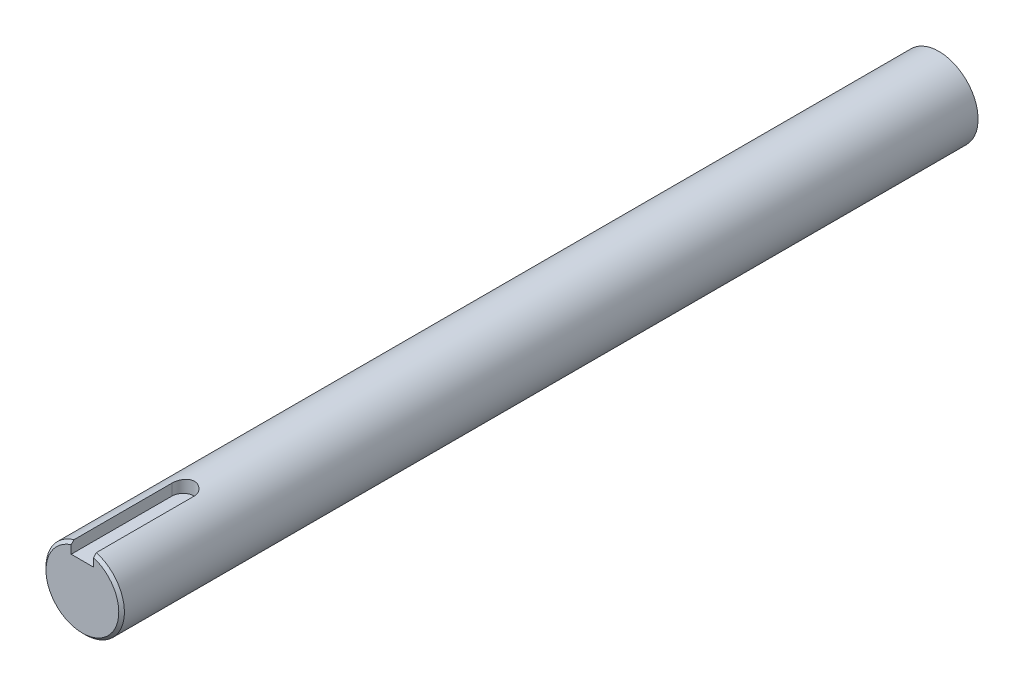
from build123d import *
from build123d.topology import SkipClean

# Parameters (mm, degrees)
EXTRUDE_1_DEPTH      = 98
SKETCH_2_R           = 7
EXTRUDE_4_DEPTH      = 80
CUT_EXTRUDE_20_DEPTH = 80
CHAMFER_1_SIZE       = 0.5
EXTRUDE_START        = 55
SKETCH_7_R           = 7
EXTRUDE_5_DEPTH      = 55


with BuildPart() as part:
    # Sketch 1 → Extrude 1 (new body)
    with BuildSketch(Plane.XY):
        with BuildLine():
            Line((2, 4.7), (-2, 4.7))
            Line((-2, 4.7), (-2, 6.708203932))
            ThreePointArc((-2, 6.708203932), (0, -7), (2, 6.708203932))
            Line((2, 6.708203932), (2, 4.7))
        make_face()
    extrude(amount=EXTRUDE_1_DEPTH)

    # Sketch 2 → Extrude 4 (add)
    with SkipClean():  # the faces are left unmerged after this step: merging them gives an invalid solid
        with BuildSketch(Plane(origin=(0, 0, 0), x_dir=(-1, 0, 0), z_dir=(0, 0, -1))):
            with Locations(Location((0, 0, 0), (0, 0, 73.398450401))):
                Circle(SKETCH_2_R)
        extrude(amount=-EXTRUDE_4_DEPTH)

    # Sketch 6 → Cut-Extrude 20 (cut)
    with SkipClean():  # the faces are left unmerged after this step: merging them gives an invalid solid
        with BuildSketch(Plane(origin=(0, 4.7, 0), x_dir=(1, 0, 0), z_dir=(0, 1, 0))):
            with BuildLine():
                Line((-2, -80), (2, -80))
                ThreePointArc((2, -80), (0, -78), (-2, -80))
            make_face()
        extrude(amount=CUT_EXTRUDE_20_DEPTH, mode=Mode.SUBTRACT)

    # Chamfer 1
    chamfer_1_edges = [part.edges().sort_by_distance(p)[0] for p in [
        (0, -7, 98),
    ]]
    chamfer(chamfer_1_edges, length=CHAMFER_1_SIZE)

    # Sketch 7 → Extrude 5 (add)
    with BuildSketch(Plane(origin=(0, 0, 0), x_dir=(-1, 0, 0), z_dir=(0, 0, -1)).offset(EXTRUDE_START)):
        Circle(SKETCH_7_R)
    extrude(amount=-EXTRUDE_5_DEPTH)


solid = part.part
